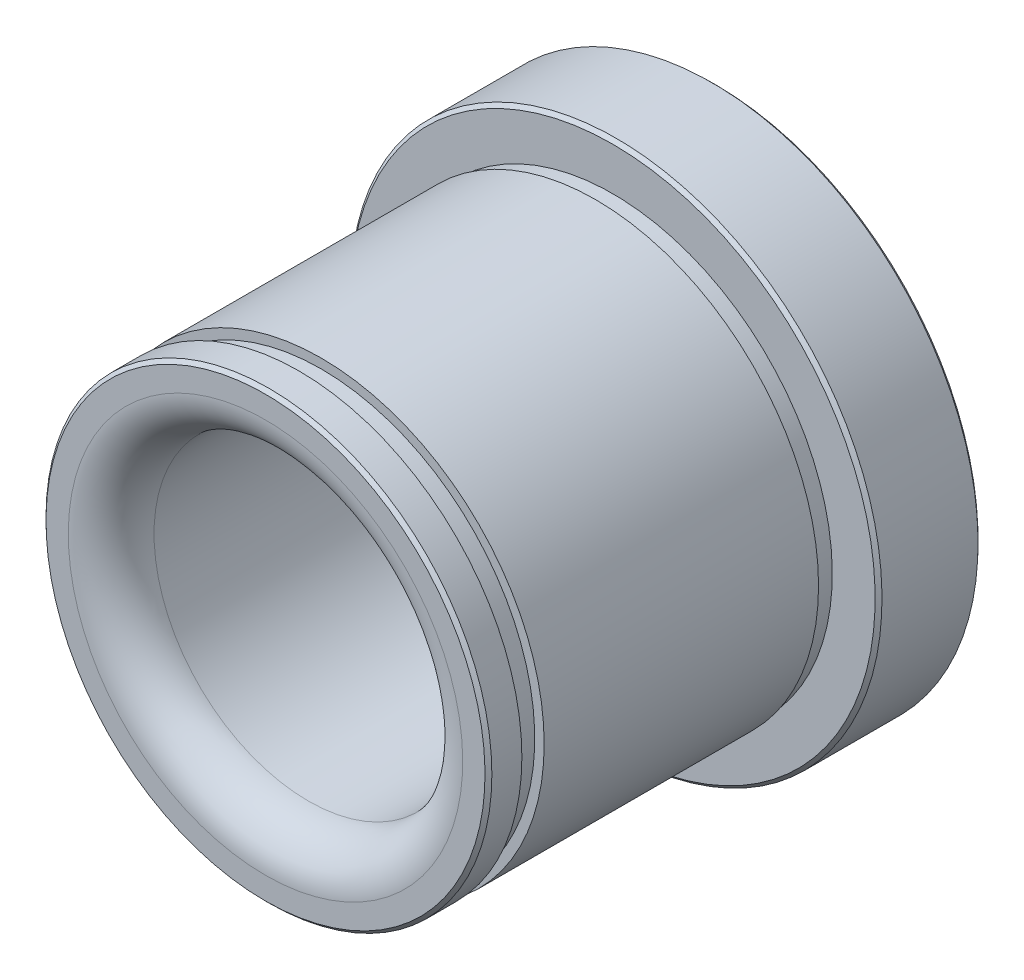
ISO-10303-21;
HEADER;
FILE_DESCRIPTION(('STEP AP214'),'2;1');
FILE_NAME('part.step','',(''),(''),'','','');
FILE_SCHEMA(('AUTOMOTIVE_DESIGN { 1 0 10303 214 1 1 1 1 }'));
ENDSEC;
DATA;
#1=APPLICATION_CONTEXT('core data for automotive mechanical design processes');
#2=APPLICATION_PROTOCOL_DEFINITION('international standard','automotive_design',2000,#1);
#3=PRODUCT_CONTEXT('',#1,'mechanical');
#4=PRODUCT('Part','Part','',(#3));
#5=PRODUCT_RELATED_PRODUCT_CATEGORY('part','',(#4));
#6=PRODUCT_DEFINITION_FORMATION('','',#4);
#7=PRODUCT_DEFINITION_CONTEXT('part definition',#1,'design');
#8=PRODUCT_DEFINITION('design','',#6,#7);
#9=PRODUCT_DEFINITION_SHAPE('','',#8);
#10=(LENGTH_UNIT() NAMED_UNIT(*) SI_UNIT(.MILLI.,.METRE.));
#11=(NAMED_UNIT(*) PLANE_ANGLE_UNIT() SI_UNIT($,.RADIAN.));
#12=(NAMED_UNIT(*) SI_UNIT($,.STERADIAN.) SOLID_ANGLE_UNIT());
#13=UNCERTAINTY_MEASURE_WITH_UNIT(LENGTH_MEASURE(1.E-05),#10,'distance_accuracy_value','');
#14=(GEOMETRIC_REPRESENTATION_CONTEXT(3) GLOBAL_UNCERTAINTY_ASSIGNED_CONTEXT((#13)) GLOBAL_UNIT_ASSIGNED_CONTEXT((#10,
#11,#12)) REPRESENTATION_CONTEXT('',''));
#15=CARTESIAN_POINT('',(0.,0.,0.));
#16=DIRECTION('',(0.,0.,1.));
#17=DIRECTION('',(1.,0.,0.));
#18=AXIS2_PLACEMENT_3D('',#15,#16,#17);
#19=CARTESIAN_POINT('',(0.,0.,26.5));
#20=DIRECTION('',(0.,0.,1.));
#21=DIRECTION('',(0.,-1.,0.));
#22=AXIS2_PLACEMENT_3D('',#19,#20,#21);
#23=CYLINDRICAL_SURFACE('',#22,13.);
#24=CARTESIAN_POINT('',(0.,0.,26.3));
#25=DIRECTION('',(0.,0.,1.));
#26=DIRECTION('',(0.,-1.,0.));
#27=AXIS2_PLACEMENT_3D('',#24,#25,#26);
#28=CIRCLE('',#27,13.);
#29=CARTESIAN_POINT('',(0.,-13.,26.3));
#30=VERTEX_POINT('',#29);
#31=EDGE_CURVE('E69',#30,#30,#28,.T.);
#32=ORIENTED_EDGE('',*,*,#31,.F.);
#33=EDGE_LOOP('',(#32));
#34=FACE_BOUND('',#33,.T.);
#35=CARTESIAN_POINT('',(0.,0.,24.55));
#36=DIRECTION('',(0.,0.,1.));
#37=DIRECTION('',(0.,-1.,0.));
#38=AXIS2_PLACEMENT_3D('',#35,#36,#37);
#39=CIRCLE('',#38,13.);
#40=CARTESIAN_POINT('',(0.,-13.,24.55));
#41=VERTEX_POINT('',#40);
#42=EDGE_CURVE('E90',#41,#41,#39,.T.);
#43=ORIENTED_EDGE('',*,*,#42,.T.);
#44=EDGE_LOOP('',(#43));
#45=FACE_BOUND('',#44,.T.);
#46=ADVANCED_FACE('F34',(#34,#45),#23,.T.);
#47=CARTESIAN_POINT('',(0.,0.,7.25));
#48=DIRECTION('',(0.,0.,1.));
#49=DIRECTION('',(0.,-1.,0.));
#50=AXIS2_PLACEMENT_3D('',#47,#48,#49);
#51=CIRCLE('',#50,13.);
#52=CARTESIAN_POINT('',(0.,-13.,7.25));
#53=VERTEX_POINT('',#52);
#54=EDGE_CURVE('E72',#53,#53,#51,.T.);
#55=ORIENTED_EDGE('',*,*,#54,.T.);
#56=EDGE_LOOP('',(#55));
#57=FACE_BOUND('',#56,.T.);
#58=CARTESIAN_POINT('',(0.,0.,23.25));
#59=DIRECTION('',(0.,0.,1.));
#60=DIRECTION('',(0.,-1.,0.));
#61=AXIS2_PLACEMENT_3D('',#58,#59,#60);
#62=CIRCLE('',#61,13.);
#63=CARTESIAN_POINT('',(0.,-13.,23.25));
#64=VERTEX_POINT('',#63);
#65=EDGE_CURVE('E87',#64,#64,#62,.T.);
#66=ORIENTED_EDGE('',*,*,#65,.F.);
#67=EDGE_LOOP('',(#66));
#68=FACE_BOUND('',#67,.T.);
#69=ADVANCED_FACE('F112',(#57,#68),#23,.T.);
#70=CARTESIAN_POINT('',(0.,15.3,6.25));
#71=DIRECTION('',(0.,0.,-1.));
#72=DIRECTION('',(0.,1.,0.));
#73=AXIS2_PLACEMENT_3D('',#70,#71,#72);
#74=PLANE('',#73);
#75=CARTESIAN_POINT('',(0.,0.,6.25000000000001));
#76=DIRECTION('',(0.,0.,1.));
#77=DIRECTION('',(0.,-1.,0.));
#78=AXIS2_PLACEMENT_3D('',#75,#76,#77);
#79=CIRCLE('',#78,12.8000000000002);
#80=CARTESIAN_POINT('',(0.,-12.8000000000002,6.25000000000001));
#81=VERTEX_POINT('',#80);
#82=EDGE_CURVE('E78',#81,#81,#79,.T.);
#83=ORIENTED_EDGE('',*,*,#82,.F.);
#84=EDGE_LOOP('',(#83));
#85=FACE_BOUND('',#84,.T.);
#86=CARTESIAN_POINT('',(0.,0.,6.25000000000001));
#87=DIRECTION('',(0.,0.,1.));
#88=DIRECTION('',(0.,-1.,0.));
#89=AXIS2_PLACEMENT_3D('',#86,#87,#88);
#90=CIRCLE('',#89,15.3);
#91=CARTESIAN_POINT('',(0.,-15.3,6.25000000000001));
#92=VERTEX_POINT('',#91);
#93=EDGE_CURVE('E10',#92,#92,#90,.T.);
#94=ORIENTED_EDGE('',*,*,#93,.T.);
#95=EDGE_LOOP('',(#94));
#96=FACE_BOUND('',#95,.T.);
#97=ADVANCED_FACE('F36',(#85,#96),#74,.F.);
#98=CARTESIAN_POINT('',(0.,0.,6.05000000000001));
#99=DIRECTION('',(0.,0.,-1.));
#100=DIRECTION('',(0.,1.,0.));
#101=AXIS2_PLACEMENT_3D('',#98,#99,#100);
#102=CONICAL_SURFACE('',#101,15.5,0.78539816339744);
#103=ORIENTED_EDGE('',*,*,#93,.F.);
#104=EDGE_LOOP('',(#103));
#105=FACE_BOUND('',#104,.T.);
#106=CARTESIAN_POINT('',(0.,0.,6.05000000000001));
#107=DIRECTION('',(0.,0.,1.));
#108=DIRECTION('',(0.,-1.,0.));
#109=AXIS2_PLACEMENT_3D('',#106,#107,#108);
#110=CIRCLE('',#109,15.5);
#111=CARTESIAN_POINT('',(0.,-15.5,6.05000000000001));
#112=VERTEX_POINT('',#111);
#113=EDGE_CURVE('E41',#112,#112,#110,.T.);
#114=ORIENTED_EDGE('',*,*,#113,.T.);
#115=EDGE_LOOP('',(#114));
#116=FACE_BOUND('',#115,.T.);
#117=ADVANCED_FACE('F152',(#105,#116),#102,.T.);
#118=CARTESIAN_POINT('',(0.,0.,26.5));
#119=DIRECTION('',(0.,0.,1.));
#120=DIRECTION('',(0.,-1.,0.));
#121=AXIS2_PLACEMENT_3D('',#118,#119,#120);
#122=CYLINDRICAL_SURFACE('',#121,15.5);
#123=ORIENTED_EDGE('',*,*,#113,.F.);
#124=EDGE_LOOP('',(#123));
#125=FACE_BOUND('',#124,.T.);
#126=CARTESIAN_POINT('',(0.,0.,0.450000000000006));
#127=DIRECTION('',(0.,0.,1.));
#128=DIRECTION('',(0.,-1.,0.));
#129=AXIS2_PLACEMENT_3D('',#126,#127,#128);
#130=CIRCLE('',#129,15.5);
#131=CARTESIAN_POINT('',(0.,-15.5,0.450000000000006));
#132=VERTEX_POINT('',#131);
#133=EDGE_CURVE('E45',#132,#132,#130,.T.);
#134=ORIENTED_EDGE('',*,*,#133,.T.);
#135=EDGE_LOOP('',(#134));
#136=FACE_BOUND('',#135,.T.);
#137=ADVANCED_FACE('F149',(#125,#136),#122,.T.);
#138=CARTESIAN_POINT('',(0.,0.,0.250000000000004));
#139=DIRECTION('',(0.,0.,1.));
#140=DIRECTION('',(0.,-1.,0.));
#141=AXIS2_PLACEMENT_3D('',#138,#139,#140);
#142=CONICAL_SURFACE('',#141,15.3,0.785398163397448);
#143=ORIENTED_EDGE('',*,*,#133,.F.);
#144=EDGE_LOOP('',(#143));
#145=FACE_BOUND('',#144,.T.);
#146=CARTESIAN_POINT('',(0.,0.,0.250000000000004));
#147=DIRECTION('',(0.,0.,1.));
#148=DIRECTION('',(0.,-1.,0.));
#149=AXIS2_PLACEMENT_3D('',#146,#147,#148);
#150=CIRCLE('',#149,15.3);
#151=CARTESIAN_POINT('',(0.,-15.3,0.250000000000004));
#152=VERTEX_POINT('',#151);
#153=EDGE_CURVE('E49',#152,#152,#150,.T.);
#154=ORIENTED_EDGE('',*,*,#153,.T.);
#155=EDGE_LOOP('',(#154));
#156=FACE_BOUND('',#155,.T.);
#157=ADVANCED_FACE('F145',(#145,#156),#142,.T.);
#158=CARTESIAN_POINT('',(0.,10.5,0.250000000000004));
#159=DIRECTION('',(0.,0.,1.));
#160=DIRECTION('',(0.,-1.,0.));
#161=AXIS2_PLACEMENT_3D('',#158,#159,#160);
#162=PLANE('',#161);
#163=ORIENTED_EDGE('',*,*,#153,.F.);
#164=EDGE_LOOP('',(#163));
#165=FACE_BOUND('',#164,.T.);
#166=CARTESIAN_POINT('',(0.,0.,0.250000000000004));
#167=DIRECTION('',(0.,0.,1.));
#168=DIRECTION('',(0.,-1.,0.));
#169=AXIS2_PLACEMENT_3D('',#166,#167,#168);
#170=CIRCLE('',#169,10.5);
#171=CARTESIAN_POINT('',(0.,-10.5,0.250000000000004));
#172=VERTEX_POINT('',#171);
#173=EDGE_CURVE('E54',#172,#172,#170,.T.);
#174=ORIENTED_EDGE('',*,*,#173,.T.);
#175=EDGE_LOOP('',(#174));
#176=FACE_BOUND('',#175,.T.);
#177=ADVANCED_FACE('F141',(#165,#176),#162,.F.);
#178=CARTESIAN_POINT('',(0.,0.,1.74999999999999));
#179=DIRECTION('',(0.,0.,-1.));
#180=DIRECTION('',(0.,1.,0.));
#181=AXIS2_PLACEMENT_3D('',#178,#179,#180);
#182=CONICAL_SURFACE('',#181,9.,0.785398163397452);
#183=ORIENTED_EDGE('',*,*,#173,.F.);
#184=EDGE_LOOP('',(#183));
#185=FACE_BOUND('',#184,.T.);
#186=CARTESIAN_POINT('',(0.,0.,1.74999999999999));
#187=DIRECTION('',(0.,0.,1.));
#188=DIRECTION('',(0.,-1.,0.));
#189=AXIS2_PLACEMENT_3D('',#186,#187,#188);
#190=CIRCLE('',#189,9.);
#191=CARTESIAN_POINT('',(0.,-9.,1.74999999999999));
#192=VERTEX_POINT('',#191);
#193=EDGE_CURVE('E57',#192,#192,#190,.T.);
#194=ORIENTED_EDGE('',*,*,#193,.T.);
#195=EDGE_LOOP('',(#194));
#196=FACE_BOUND('',#195,.T.);
#197=ADVANCED_FACE('F137',(#185,#196),#182,.F.);
#198=CARTESIAN_POINT('',(0.,0.,26.5));
#199=DIRECTION('',(0.,0.,1.));
#200=DIRECTION('',(0.,-1.,0.));
#201=AXIS2_PLACEMENT_3D('',#198,#199,#200);
#202=CYLINDRICAL_SURFACE('',#201,9.);
#203=ORIENTED_EDGE('',*,*,#193,.F.);
#204=EDGE_LOOP('',(#203));
#205=FACE_BOUND('',#204,.T.);
#206=CARTESIAN_POINT('',(0.,0.,24.));
#207=DIRECTION('',(0.,0.,1.));
#208=DIRECTION('',(0.,-1.,0.));
#209=AXIS2_PLACEMENT_3D('',#206,#207,#208);
#210=CIRCLE('',#209,9.);
#211=CARTESIAN_POINT('',(0.,-9.,24.));
#212=VERTEX_POINT('',#211);
#213=EDGE_CURVE('E60',#212,#212,#210,.T.);
#214=ORIENTED_EDGE('',*,*,#213,.T.);
#215=EDGE_LOOP('',(#214));
#216=FACE_BOUND('',#215,.T.);
#217=ADVANCED_FACE('F133',(#205,#216),#202,.F.);
#218=CARTESIAN_POINT('',(0.,0.,24.));
#219=DIRECTION('',(0.,0.,1.));
#220=DIRECTION('',(0.,-1.,0.));
#221=AXIS2_PLACEMENT_3D('',#218,#219,#220);
#222=TOROIDAL_SURFACE('',#221,11.5,2.5);
#223=ORIENTED_EDGE('',*,*,#213,.F.);
#224=EDGE_LOOP('',(#223));
#225=FACE_BOUND('',#224,.T.);
#226=CARTESIAN_POINT('',(0.,0.,26.5));
#227=DIRECTION('',(0.,0.,1.));
#228=DIRECTION('',(0.,-1.,0.));
#229=AXIS2_PLACEMENT_3D('',#226,#227,#228);
#230=CIRCLE('',#229,11.5);
#231=CARTESIAN_POINT('',(0.,-11.5,26.5));
#232=VERTEX_POINT('',#231);
#233=EDGE_CURVE('E63',#232,#232,#230,.T.);
#234=ORIENTED_EDGE('',*,*,#233,.T.);
#235=EDGE_LOOP('',(#234));
#236=FACE_BOUND('',#235,.T.);
#237=ADVANCED_FACE('F129',(#225,#236),#222,.T.);
#238=CARTESIAN_POINT('',(0.,12.8000000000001,26.5));
#239=DIRECTION('',(0.,0.,-1.));
#240=DIRECTION('',(0.,1.,0.));
#241=AXIS2_PLACEMENT_3D('',#238,#239,#240);
#242=PLANE('',#241);
#243=ORIENTED_EDGE('',*,*,#233,.F.);
#244=EDGE_LOOP('',(#243));
#245=FACE_BOUND('',#244,.T.);
#246=CARTESIAN_POINT('',(0.,0.,26.5));
#247=DIRECTION('',(0.,0.,1.));
#248=DIRECTION('',(0.,-1.,0.));
#249=AXIS2_PLACEMENT_3D('',#246,#247,#248);
#250=CIRCLE('',#249,12.8000000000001);
#251=CARTESIAN_POINT('',(0.,-12.8000000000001,26.5));
#252=VERTEX_POINT('',#251);
#253=EDGE_CURVE('E66',#252,#252,#250,.T.);
#254=ORIENTED_EDGE('',*,*,#253,.T.);
#255=EDGE_LOOP('',(#254));
#256=FACE_BOUND('',#255,.T.);
#257=ADVANCED_FACE('F125',(#245,#256),#242,.F.);
#258=CARTESIAN_POINT('',(0.,0.,26.3));
#259=DIRECTION('',(0.,0.,-1.));
#260=DIRECTION('',(0.,1.,0.));
#261=AXIS2_PLACEMENT_3D('',#258,#259,#260);
#262=CONICAL_SURFACE('',#261,13.,0.785398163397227);
#263=ORIENTED_EDGE('',*,*,#253,.F.);
#264=EDGE_LOOP('',(#263));
#265=FACE_BOUND('',#264,.T.);
#266=ORIENTED_EDGE('',*,*,#31,.T.);
#267=EDGE_LOOP('',(#266));
#268=FACE_BOUND('',#267,.T.);
#269=ADVANCED_FACE('F122',(#265,#268),#262,.T.);
#270=CARTESIAN_POINT('',(0.,12.8000000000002,7.25));
#271=DIRECTION('',(0.,0.,1.));
#272=DIRECTION('',(0.,-1.,0.));
#273=AXIS2_PLACEMENT_3D('',#270,#271,#272);
#274=PLANE('',#273);
#275=ORIENTED_EDGE('',*,*,#54,.F.);
#276=EDGE_LOOP('',(#275));
#277=FACE_BOUND('',#276,.T.);
#278=CARTESIAN_POINT('',(0.,0.,7.25));
#279=DIRECTION('',(0.,0.,1.));
#280=DIRECTION('',(0.,-1.,0.));
#281=AXIS2_PLACEMENT_3D('',#278,#279,#280);
#282=CIRCLE('',#281,12.8000000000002);
#283=CARTESIAN_POINT('',(0.,-12.8000000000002,7.25));
#284=VERTEX_POINT('',#283);
#285=EDGE_CURVE('E75',#284,#284,#282,.T.);
#286=ORIENTED_EDGE('',*,*,#285,.T.);
#287=EDGE_LOOP('',(#286));
#288=FACE_BOUND('',#287,.T.);
#289=ADVANCED_FACE('F108',(#277,#288),#274,.F.);
#290=CARTESIAN_POINT('',(0.,0.,26.5));
#291=DIRECTION('',(0.,0.,1.));
#292=DIRECTION('',(0.,-1.,0.));
#293=AXIS2_PLACEMENT_3D('',#290,#291,#292);
#294=CYLINDRICAL_SURFACE('',#293,12.8000000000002);
#295=ORIENTED_EDGE('',*,*,#285,.F.);
#296=EDGE_LOOP('',(#295));
#297=FACE_BOUND('',#296,.T.);
#298=ORIENTED_EDGE('',*,*,#82,.T.);
#299=EDGE_LOOP('',(#298));
#300=FACE_BOUND('',#299,.T.);
#301=ADVANCED_FACE('F98',(#297,#300),#294,.T.);
#302=CARTESIAN_POINT('',(0.,13.,24.55));
#303=DIRECTION('',(0.,0.,-1.));
#304=DIRECTION('',(0.,1.,0.));
#305=AXIS2_PLACEMENT_3D('',#302,#303,#304);
#306=PLANE('',#305);
#307=CARTESIAN_POINT('',(0.,0.,24.55));
#308=DIRECTION('',(0.,0.,1.));
#309=DIRECTION('',(0.,-1.,0.));
#310=AXIS2_PLACEMENT_3D('',#307,#308,#309);
#311=CIRCLE('',#310,12.45);
#312=CARTESIAN_POINT('',(0.,-12.45,24.55));
#313=VERTEX_POINT('',#312);
#314=EDGE_CURVE('E81',#313,#313,#311,.T.);
#315=ORIENTED_EDGE('',*,*,#314,.T.);
#316=EDGE_LOOP('',(#315));
#317=FACE_BOUND('',#316,.T.);
#318=ORIENTED_EDGE('',*,*,#42,.F.);
#319=EDGE_LOOP('',(#318));
#320=FACE_BOUND('',#319,.T.);
#321=ADVANCED_FACE('F95',(#317,#320),#306,.T.);
#322=CARTESIAN_POINT('',(0.,0.,26.5));
#323=DIRECTION('',(0.,0.,1.));
#324=DIRECTION('',(0.,-1.,0.));
#325=AXIS2_PLACEMENT_3D('',#322,#323,#324);
#326=CYLINDRICAL_SURFACE('',#325,12.45);
#327=CARTESIAN_POINT('',(0.,0.,23.25));
#328=DIRECTION('',(0.,0.,1.));
#329=DIRECTION('',(0.,-1.,0.));
#330=AXIS2_PLACEMENT_3D('',#327,#328,#329);
#331=CIRCLE('',#330,12.45);
#332=CARTESIAN_POINT('',(0.,-12.45,23.25));
#333=VERTEX_POINT('',#332);
#334=EDGE_CURVE('E84',#333,#333,#331,.T.);
#335=ORIENTED_EDGE('',*,*,#334,.T.);
#336=EDGE_LOOP('',(#335));
#337=FACE_BOUND('',#336,.T.);
#338=ORIENTED_EDGE('',*,*,#314,.F.);
#339=EDGE_LOOP('',(#338));
#340=FACE_BOUND('',#339,.T.);
#341=ADVANCED_FACE('F97',(#337,#340),#326,.T.);
#342=CARTESIAN_POINT('',(0.,12.45,23.25));
#343=DIRECTION('',(0.,0.,1.));
#344=DIRECTION('',(0.,-1.,0.));
#345=AXIS2_PLACEMENT_3D('',#342,#343,#344);
#346=PLANE('',#345);
#347=ORIENTED_EDGE('',*,*,#65,.T.);
#348=EDGE_LOOP('',(#347));
#349=FACE_BOUND('',#348,.T.);
#350=ORIENTED_EDGE('',*,*,#334,.F.);
#351=EDGE_LOOP('',(#350));
#352=FACE_BOUND('',#351,.T.);
#353=ADVANCED_FACE('F105',(#349,#352),#346,.T.);
#354=CLOSED_SHELL('',(#46,#69,#97,#117,#137,#157,#177,#197,#217,#237,#257,#269,#289,#301,#321,
#341,#353));
#355=MANIFOLD_SOLID_BREP('B2',#354);
#356=ADVANCED_BREP_SHAPE_REPRESENTATION('',(#18,#355),#14);
#357=SHAPE_DEFINITION_REPRESENTATION(#9,#356);
ENDSEC;
END-ISO-10303-21;
